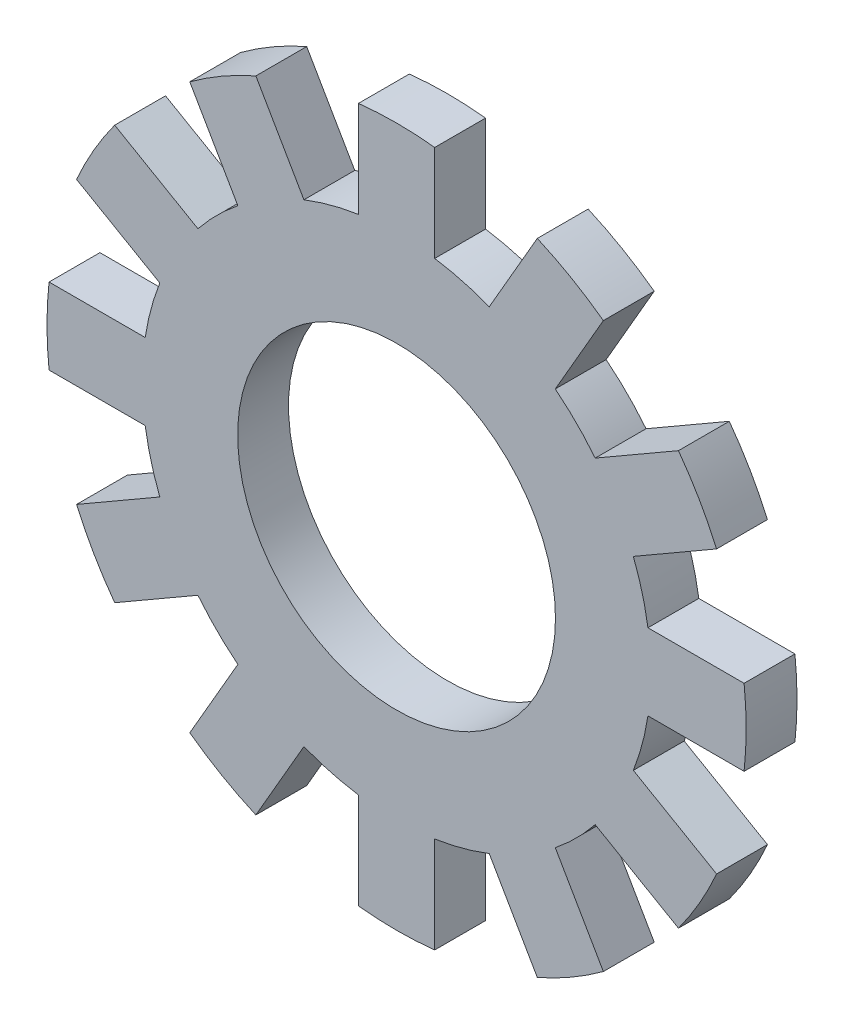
from build123d import *

# Parameters (mm, degrees)
SKETCH1_R                 = 2
SKETCH1_R_2               = 1.25
BOSS_EXTRUDE1_DEPTH       = 0.2
BOSS_EXTRUDE2_DEPTH       = 0.2
CIRPATTERN2_COUNT         = 12
CIRPATTERN2_COPY_1_DEPTH  = 0.2
CIRPATTERN2_COPY_2_DEPTH  = 0.2
CIRPATTERN2_COPY_3_DEPTH  = 0.2
CIRPATTERN2_COPY_4_DEPTH  = 0.2
CIRPATTERN2_COPY_5_DEPTH  = 0.2
CIRPATTERN2_COPY_6_DEPTH  = 0.2
CIRPATTERN2_COPY_7_DEPTH  = 0.2
CIRPATTERN2_COPY_8_DEPTH  = 0.2
CIRPATTERN2_COPY_9_DEPTH  = 0.2
CIRPATTERN2_COPY_10_DEPTH = 0.2
CIRPATTERN2_COPY_11_DEPTH = 0.2


with BuildPart() as part:
    # Sketch1 → Boss-Extrude1 (new, symmetric)
    with BuildSketch(Plane.XY):
        Circle(SKETCH1_R)
        Circle(SKETCH1_R_2, mode=Mode.SUBTRACT)
    extrude(amount=BOSS_EXTRUDE1_DEPTH, both=True)

    # Sketch3 → Boss-Extrude2 (add, symmetric)
    with BuildSketch(Plane.XY):
        with BuildLine():
            Line((-0.3, 2.733587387), (-0.3, 1.977371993))
            ThreePointArc((-0.3, 1.977371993), (-0.150426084, 1.994334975), (0, 2))
            Line((0, 2), (0, 2.75))
            ThreePointArc((0, 2.75), (-0.150224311, 2.745893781), (-0.3, 2.733587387))
        make_face()
    boss_extrude2 = extrude(amount=BOSS_EXTRUDE2_DEPTH, both=True)

    # Mirror1: Boss-Extrude2 across plane
    add(boss_extrude2.mirror(Plane(origin=(0, 0, 0), x_dir=(0, 0, 1), z_dir=(1, 0, 0))))

    # CirPattern2: Boss-Extrude2 ×12 about axis
    cirpattern2_axis = Axis((0, 0, 0), (0, 0, 1))
    for i in range(1, CIRPATTERN2_COUNT):
        add(boss_extrude2.rotate(cirpattern2_axis, i * 360 / CIRPATTERN2_COUNT))

    # CirPattern2 copy 1 sketch → CirPattern2 copy 1 (add, symmetric)
    with BuildSketch(Plane(origin=(0, 0, 0), x_dir=(-0.8660254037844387, -0.49999999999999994, 0), z_dir=(0, 0, 1))):
        with BuildLine():
            Line((-0.3, -2.733587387), (-0.3, -1.977371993))
            ThreePointArc((-0.3, -1.977371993), (-0.150426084, -1.994334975), (0, -2))
            Line((0, -2), (0, -2.75))
            ThreePointArc((0, -2.75), (-0.150224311, -2.745893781), (-0.3, -2.733587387))
        make_face()
    extrude(amount=CIRPATTERN2_COPY_1_DEPTH, both=True)

    # CirPattern2 copy 2 sketch → CirPattern2 copy 2 (add, symmetric)
    with BuildSketch(Plane(origin=(0, 0, 0), x_dir=(-0.5000000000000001, -0.8660254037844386, 0), z_dir=(0, 0, 1))):
        with BuildLine():
            Line((-0.3, -2.733587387), (-0.3, -1.977371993))
            ThreePointArc((-0.3, -1.977371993), (-0.150426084, -1.994334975), (0, -2))
            Line((0, -2), (0, -2.75))
            ThreePointArc((0, -2.75), (-0.150224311, -2.745893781), (-0.3, -2.733587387))
        make_face()
    extrude(amount=CIRPATTERN2_COPY_2_DEPTH, both=True)

    # CirPattern2 copy 3 sketch → CirPattern2 copy 3 (add, symmetric)
    with BuildSketch(Plane(origin=(0, 0, 0), x_dir=(0, -1, 0), z_dir=(0, 0, 1))):
        with BuildLine():
            Line((-0.3, -2.733587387), (-0.3, -1.977371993))
            ThreePointArc((-0.3, -1.977371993), (-0.150426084, -1.994334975), (0, -2))
            Line((0, -2), (0, -2.75))
            ThreePointArc((0, -2.75), (-0.150224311, -2.745893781), (-0.3, -2.733587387))
        make_face()
    extrude(amount=CIRPATTERN2_COPY_3_DEPTH, both=True)

    # CirPattern2 copy 4 sketch → CirPattern2 copy 4 (add, symmetric)
    with BuildSketch(Plane(origin=(0, 0, 0), x_dir=(0.4999999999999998, -0.8660254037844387, 0), z_dir=(0, 0, 1))):
        with BuildLine():
            Line((-0.3, -2.733587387), (-0.3, -1.977371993))
            ThreePointArc((-0.3, -1.977371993), (-0.150426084, -1.994334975), (0, -2))
            Line((0, -2), (0, -2.75))
            ThreePointArc((0, -2.75), (-0.150224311, -2.745893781), (-0.3, -2.733587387))
        make_face()
    extrude(amount=CIRPATTERN2_COPY_4_DEPTH, both=True)

    # CirPattern2 copy 5 sketch → CirPattern2 copy 5 (add, symmetric)
    with BuildSketch(Plane(origin=(0, 0, 0), x_dir=(0.8660254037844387, -0.49999999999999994, 0), z_dir=(0, 0, 1))):
        with BuildLine():
            Line((-0.3, -2.733587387), (-0.3, -1.977371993))
            ThreePointArc((-0.3, -1.977371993), (-0.150426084, -1.994334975), (0, -2))
            Line((0, -2), (0, -2.75))
            ThreePointArc((0, -2.75), (-0.150224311, -2.745893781), (-0.3, -2.733587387))
        make_face()
    extrude(amount=CIRPATTERN2_COPY_5_DEPTH, both=True)

    # CirPattern2 copy 6 sketch → CirPattern2 copy 6 (add, symmetric)
    with BuildSketch(Plane.XY):
        with BuildLine():
            Line((-0.3, -2.733587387), (-0.3, -1.977371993))
            ThreePointArc((-0.3, -1.977371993), (-0.150426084, -1.994334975), (0, -2))
            Line((0, -2), (0, -2.75))
            ThreePointArc((0, -2.75), (-0.150224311, -2.745893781), (-0.3, -2.733587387))
        make_face()
    extrude(amount=CIRPATTERN2_COPY_6_DEPTH, both=True)

    # CirPattern2 copy 7 sketch → CirPattern2 copy 7 (add, symmetric)
    with BuildSketch(Plane(origin=(0, 0, 0), x_dir=(0.8660254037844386, 0.5000000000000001, 0), z_dir=(0, 0, 1))):
        with BuildLine():
            Line((-0.3, -2.733587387), (-0.3, -1.977371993))
            ThreePointArc((-0.3, -1.977371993), (-0.150426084, -1.994334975), (0, -2))
            Line((0, -2), (0, -2.75))
            ThreePointArc((0, -2.75), (-0.150224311, -2.745893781), (-0.3, -2.733587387))
        make_face()
    extrude(amount=CIRPATTERN2_COPY_7_DEPTH, both=True)

    # CirPattern2 copy 8 sketch → CirPattern2 copy 8 (add, symmetric)
    with BuildSketch(Plane(origin=(0, 0, 0), x_dir=(0.5000000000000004, 0.8660254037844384, 0), z_dir=(0, 0, 1))):
        with BuildLine():
            Line((-0.3, -2.733587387), (-0.3, -1.977371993))
            ThreePointArc((-0.3, -1.977371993), (-0.150426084, -1.994334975), (0, -2))
            Line((0, -2), (0, -2.75))
            ThreePointArc((0, -2.75), (-0.150224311, -2.745893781), (-0.3, -2.733587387))
        make_face()
    extrude(amount=CIRPATTERN2_COPY_8_DEPTH, both=True)

    # CirPattern2 copy 9 sketch → CirPattern2 copy 9 (add, symmetric)
    with BuildSketch(Plane(origin=(0, 0, 0), x_dir=(0, 1, 0), z_dir=(0, 0, 1))):
        with BuildLine():
            Line((-0.3, -2.733587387), (-0.3, -1.977371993))
            ThreePointArc((-0.3, -1.977371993), (-0.150426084, -1.994334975), (0, -2))
            Line((0, -2), (0, -2.75))
            ThreePointArc((0, -2.75), (-0.150224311, -2.745893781), (-0.3, -2.733587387))
        make_face()
    extrude(amount=CIRPATTERN2_COPY_9_DEPTH, both=True)

    # CirPattern2 copy 10 sketch → CirPattern2 copy 10 (add, symmetric)
    with BuildSketch(Plane(origin=(0, 0, 0), x_dir=(-0.5000000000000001, 0.8660254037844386, 0), z_dir=(0, 0, 1))):
        with BuildLine():
            Line((-0.3, -2.733587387), (-0.3, -1.977371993))
            ThreePointArc((-0.3, -1.977371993), (-0.150426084, -1.994334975), (0, -2))
            Line((0, -2), (0, -2.75))
            ThreePointArc((0, -2.75), (-0.150224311, -2.745893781), (-0.3, -2.733587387))
        make_face()
    extrude(amount=CIRPATTERN2_COPY_10_DEPTH, both=True)

    # CirPattern2 copy 11 sketch → CirPattern2 copy 11 (add, symmetric)
    with BuildSketch(Plane(origin=(0, 0, 0), x_dir=(-0.8660254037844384, 0.5000000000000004, 0), z_dir=(0, 0, 1))):
        with BuildLine():
            Line((-0.3, -2.733587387), (-0.3, -1.977371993))
            ThreePointArc((-0.3, -1.977371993), (-0.150426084, -1.994334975), (0, -2))
            Line((0, -2), (0, -2.75))
            ThreePointArc((0, -2.75), (-0.150224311, -2.745893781), (-0.3, -2.733587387))
        make_face()
    extrude(amount=CIRPATTERN2_COPY_11_DEPTH, both=True)


solid = part.part
